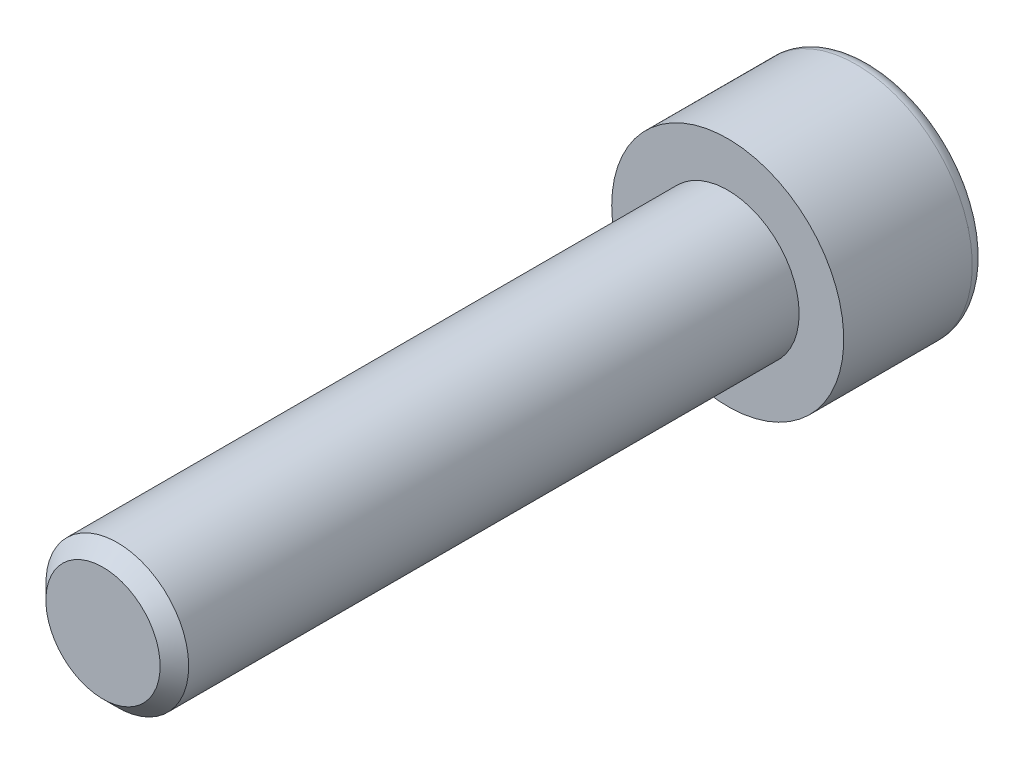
ISO-10303-21;
HEADER;
FILE_DESCRIPTION(('STEP AP214'),'2;1');
FILE_NAME('part.step','',(''),(''),'','','');
FILE_SCHEMA(('AUTOMOTIVE_DESIGN { 1 0 10303 214 1 1 1 1 }'));
ENDSEC;
DATA;
#1=APPLICATION_CONTEXT('core data for automotive mechanical design processes');
#2=APPLICATION_PROTOCOL_DEFINITION('international standard','automotive_design',2000,#1);
#3=PRODUCT_CONTEXT('',#1,'mechanical');
#4=PRODUCT('Part','Part','',(#3));
#5=PRODUCT_RELATED_PRODUCT_CATEGORY('part','',(#4));
#6=PRODUCT_DEFINITION_FORMATION('','',#4);
#7=PRODUCT_DEFINITION_CONTEXT('part definition',#1,'design');
#8=PRODUCT_DEFINITION('design','',#6,#7);
#9=PRODUCT_DEFINITION_SHAPE('','',#8);
#10=(LENGTH_UNIT() NAMED_UNIT(*) SI_UNIT(.MILLI.,.METRE.));
#11=(NAMED_UNIT(*) PLANE_ANGLE_UNIT() SI_UNIT($,.RADIAN.));
#12=(NAMED_UNIT(*) SI_UNIT($,.STERADIAN.) SOLID_ANGLE_UNIT());
#13=UNCERTAINTY_MEASURE_WITH_UNIT(LENGTH_MEASURE(1.E-05),#10,'distance_accuracy_value','');
#14=(GEOMETRIC_REPRESENTATION_CONTEXT(3) GLOBAL_UNCERTAINTY_ASSIGNED_CONTEXT((#13)) GLOBAL_UNIT_ASSIGNED_CONTEXT((#10,
#11,#12)) REPRESENTATION_CONTEXT('',''));
#15=CARTESIAN_POINT('',(0.,0.,0.));
#16=DIRECTION('',(0.,0.,1.));
#17=DIRECTION('',(1.,0.,0.));
#18=AXIS2_PLACEMENT_3D('',#15,#16,#17);
#19=CARTESIAN_POINT('',(0.,0.,-8.));
#20=DIRECTION('',(0.,0.,1.));
#21=DIRECTION('',(1.,0.,0.));
#22=AXIS2_PLACEMENT_3D('',#19,#20,#21);
#23=PLANE('',#22);
#24=CARTESIAN_POINT('',(0.,0.,-8.));
#25=DIRECTION('',(0.,0.,-1.));
#26=DIRECTION('',(-1.,0.,0.));
#27=AXIS2_PLACEMENT_3D('',#24,#25,#26);
#28=CIRCLE('',#27,5.7);
#29=CARTESIAN_POINT('',(-5.7,0.,-8.));
#30=VERTEX_POINT('',#29);
#31=EDGE_CURVE('E147',#30,#30,#28,.T.);
#32=ORIENTED_EDGE('',*,*,#31,.T.);
#33=EDGE_LOOP('',(#32));
#34=FACE_BOUND('',#33,.T.);
#35=DIRECTION('',(-0.86602540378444,0.499999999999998,0.));
#36=VECTOR('',#35,1.);
#37=CARTESIAN_POINT('',(0.,3.46410161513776,-8.));
#38=LINE('',#37,#36);
#39=CARTESIAN_POINT('',(3.,1.73205080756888,-8.));
#40=VERTEX_POINT('',#39);
#41=CARTESIAN_POINT('',(0.,3.46410161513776,-8.));
#42=VERTEX_POINT('',#41);
#43=EDGE_CURVE('E49',#40,#42,#38,.T.);
#44=ORIENTED_EDGE('',*,*,#43,.T.);
#45=DIRECTION('',(-0.866025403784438,-0.500000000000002,0.));
#46=VECTOR('',#45,1.);
#47=CARTESIAN_POINT('',(0.,3.46410161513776,-8.));
#48=LINE('',#47,#46);
#49=CARTESIAN_POINT('',(-3.,1.73205080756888,-8.));
#50=VERTEX_POINT('',#49);
#51=EDGE_CURVE('E120',#42,#50,#48,.T.);
#52=ORIENTED_EDGE('',*,*,#51,.T.);
#53=DIRECTION('',(0.,-1.,0.));
#54=VECTOR('',#53,1.);
#55=CARTESIAN_POINT('',(-3.,-1.73205080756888,-8.));
#56=LINE('',#55,#54);
#57=CARTESIAN_POINT('',(-3.,-1.73205080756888,-8.));
#58=VERTEX_POINT('',#57);
#59=EDGE_CURVE('E124',#50,#58,#56,.T.);
#60=ORIENTED_EDGE('',*,*,#59,.T.);
#61=DIRECTION('',(0.866025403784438,-0.500000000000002,0.));
#62=VECTOR('',#61,1.);
#63=CARTESIAN_POINT('',(0.,-3.46410161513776,-8.));
#64=LINE('',#63,#62);
#65=CARTESIAN_POINT('',(0.,-3.46410161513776,-8.));
#66=VERTEX_POINT('',#65);
#67=EDGE_CURVE('E127',#58,#66,#64,.T.);
#68=ORIENTED_EDGE('',*,*,#67,.T.);
#69=DIRECTION('',(0.86602540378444,0.499999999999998,0.));
#70=VECTOR('',#69,1.);
#71=CARTESIAN_POINT('',(0.,-3.46410161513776,-8.));
#72=LINE('',#71,#70);
#73=CARTESIAN_POINT('',(3.,-1.73205080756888,-8.));
#74=VERTEX_POINT('',#73);
#75=EDGE_CURVE('E110',#66,#74,#72,.T.);
#76=ORIENTED_EDGE('',*,*,#75,.T.);
#77=DIRECTION('',(0.,1.,0.));
#78=VECTOR('',#77,1.);
#79=CARTESIAN_POINT('',(3.,-1.73205080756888,-8.));
#80=LINE('',#79,#78);
#81=EDGE_CURVE('E130',#74,#40,#80,.T.);
#82=ORIENTED_EDGE('',*,*,#81,.T.);
#83=EDGE_LOOP('',(#44,#52,#60,#68,#76,#82));
#84=FACE_BOUND('',#83,.T.);
#85=ADVANCED_FACE('F34',(#34,#84),#23,.F.);
#86=CARTESIAN_POINT('',(0.,0.,-7.2));
#87=DIRECTION('',(0.,0.,-1.));
#88=DIRECTION('',(-1.,0.,0.));
#89=AXIS2_PLACEMENT_3D('',#86,#87,#88);
#90=TOROIDAL_SURFACE('',#89,5.7,0.8);
#91=ORIENTED_EDGE('',*,*,#31,.F.);
#92=EDGE_LOOP('',(#91));
#93=FACE_BOUND('',#92,.T.);
#94=CARTESIAN_POINT('',(0.,0.,-7.2));
#95=DIRECTION('',(0.,0.,-1.));
#96=DIRECTION('',(-1.,0.,0.));
#97=AXIS2_PLACEMENT_3D('',#94,#95,#96);
#98=CIRCLE('',#97,6.5);
#99=CARTESIAN_POINT('',(-6.5,0.,-7.2));
#100=VERTEX_POINT('',#99);
#101=EDGE_CURVE('E144',#100,#100,#98,.T.);
#102=ORIENTED_EDGE('',*,*,#101,.T.);
#103=EDGE_LOOP('',(#102));
#104=FACE_BOUND('',#103,.T.);
#105=ADVANCED_FACE('F164',(#93,#104),#90,.T.);
#106=CARTESIAN_POINT('',(0.,0.,0.));
#107=DIRECTION('',(0.,0.,-1.));
#108=DIRECTION('',(-1.,0.,0.));
#109=AXIS2_PLACEMENT_3D('',#106,#107,#108);
#110=CYLINDRICAL_SURFACE('',#109,6.5);
#111=ORIENTED_EDGE('',*,*,#101,.F.);
#112=EDGE_LOOP('',(#111));
#113=FACE_BOUND('',#112,.T.);
#114=CARTESIAN_POINT('',(0.,0.,0.));
#115=DIRECTION('',(0.,0.,-1.));
#116=DIRECTION('',(-1.,0.,0.));
#117=AXIS2_PLACEMENT_3D('',#114,#115,#116);
#118=CIRCLE('',#117,6.5);
#119=CARTESIAN_POINT('',(-6.5,0.,0.));
#120=VERTEX_POINT('',#119);
#121=EDGE_CURVE('E141',#120,#120,#118,.T.);
#122=ORIENTED_EDGE('',*,*,#121,.T.);
#123=EDGE_LOOP('',(#122));
#124=FACE_BOUND('',#123,.T.);
#125=ADVANCED_FACE('F169',(#113,#124),#110,.T.);
#126=CARTESIAN_POINT('',(0.,0.,0.));
#127=DIRECTION('',(0.,0.,-1.));
#128=DIRECTION('',(-1.,0.,0.));
#129=AXIS2_PLACEMENT_3D('',#126,#127,#128);
#130=PLANE('',#129);
#131=CARTESIAN_POINT('',(0.,0.,0.));
#132=DIRECTION('',(0.,0.,1.));
#133=DIRECTION('',(1.,0.,0.));
#134=AXIS2_PLACEMENT_3D('',#131,#132,#133);
#135=CIRCLE('',#134,4.);
#136=CARTESIAN_POINT('',(4.,0.,0.));
#137=VERTEX_POINT('',#136);
#138=EDGE_CURVE('E121',#137,#137,#135,.T.);
#139=ORIENTED_EDGE('',*,*,#138,.F.);
#140=EDGE_LOOP('',(#139));
#141=FACE_BOUND('',#140,.T.);
#142=ORIENTED_EDGE('',*,*,#121,.F.);
#143=EDGE_LOOP('',(#142));
#144=FACE_BOUND('',#143,.T.);
#145=ADVANCED_FACE('F176',(#141,#144),#130,.F.);
#146=CARTESIAN_POINT('',(0.,3.46410161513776,-4.));
#147=DIRECTION('',(-0.499999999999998,-0.86602540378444,0.));
#148=DIRECTION('',(0.86602540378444,-0.499999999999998,0.));
#149=AXIS2_PLACEMENT_3D('',#146,#147,#148);
#150=PLANE('',#149);
#151=ORIENTED_EDGE('',*,*,#43,.F.);
#152=DIRECTION('',(0.,0.,-1.));
#153=VECTOR('',#152,1.);
#154=CARTESIAN_POINT('',(3.,1.73205080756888,-4.));
#155=LINE('',#154,#153);
#156=CARTESIAN_POINT('',(3.,1.73205080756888,-4.));
#157=VERTEX_POINT('',#156);
#158=EDGE_CURVE('E115',#157,#40,#155,.T.);
#159=ORIENTED_EDGE('',*,*,#158,.F.);
#160=DIRECTION('',(-0.86602540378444,0.499999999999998,0.));
#161=VECTOR('',#160,1.);
#162=CARTESIAN_POINT('',(0.,3.46410161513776,-4.));
#163=LINE('',#162,#161);
#164=CARTESIAN_POINT('',(0.,3.46410161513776,-4.));
#165=VERTEX_POINT('',#164);
#166=EDGE_CURVE('E133',#157,#165,#163,.T.);
#167=ORIENTED_EDGE('',*,*,#166,.T.);
#168=DIRECTION('',(0.,0.,-1.));
#169=VECTOR('',#168,1.);
#170=CARTESIAN_POINT('',(0.,3.46410161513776,-4.));
#171=LINE('',#170,#169);
#172=EDGE_CURVE('E139',#165,#42,#171,.T.);
#173=ORIENTED_EDGE('',*,*,#172,.T.);
#174=EDGE_LOOP('',(#151,#159,#167,#173));
#175=FACE_BOUND('',#174,.T.);
#176=ADVANCED_FACE('F180',(#175),#150,.T.);
#177=CARTESIAN_POINT('',(0.,3.46410161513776,-4.));
#178=DIRECTION('',(0.500000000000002,-0.866025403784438,0.));
#179=DIRECTION('',(0.866025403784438,0.500000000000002,0.));
#180=AXIS2_PLACEMENT_3D('',#177,#178,#179);
#181=PLANE('',#180);
#182=ORIENTED_EDGE('',*,*,#51,.F.);
#183=ORIENTED_EDGE('',*,*,#172,.F.);
#184=DIRECTION('',(-0.866025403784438,-0.500000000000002,0.));
#185=VECTOR('',#184,1.);
#186=CARTESIAN_POINT('',(0.,3.46410161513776,-4.));
#187=LINE('',#186,#185);
#188=CARTESIAN_POINT('',(-3.,1.73205080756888,-4.));
#189=VERTEX_POINT('',#188);
#190=EDGE_CURVE('E88',#165,#189,#187,.T.);
#191=ORIENTED_EDGE('',*,*,#190,.T.);
#192=DIRECTION('',(0.,0.,-1.));
#193=VECTOR('',#192,1.);
#194=CARTESIAN_POINT('',(-3.,1.73205080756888,-4.));
#195=LINE('',#194,#193);
#196=EDGE_CURVE('E137',#189,#50,#195,.T.);
#197=ORIENTED_EDGE('',*,*,#196,.T.);
#198=EDGE_LOOP('',(#182,#183,#191,#197));
#199=FACE_BOUND('',#198,.T.);
#200=ADVANCED_FACE('F184',(#199),#181,.T.);
#201=CARTESIAN_POINT('',(-3.,-1.73205080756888,-4.));
#202=DIRECTION('',(1.,0.,0.));
#203=DIRECTION('',(0.,0.,-1.));
#204=AXIS2_PLACEMENT_3D('',#201,#202,#203);
#205=PLANE('',#204);
#206=ORIENTED_EDGE('',*,*,#59,.F.);
#207=ORIENTED_EDGE('',*,*,#196,.F.);
#208=DIRECTION('',(0.,-1.,0.));
#209=VECTOR('',#208,1.);
#210=CARTESIAN_POINT('',(-3.,-1.73205080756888,-4.));
#211=LINE('',#210,#209);
#212=CARTESIAN_POINT('',(-3.,-1.73205080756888,-4.));
#213=VERTEX_POINT('',#212);
#214=EDGE_CURVE('E106',#189,#213,#211,.T.);
#215=ORIENTED_EDGE('',*,*,#214,.T.);
#216=DIRECTION('',(0.,0.,-1.));
#217=VECTOR('',#216,1.);
#218=CARTESIAN_POINT('',(-3.,-1.73205080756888,-4.));
#219=LINE('',#218,#217);
#220=EDGE_CURVE('E103',#213,#58,#219,.T.);
#221=ORIENTED_EDGE('',*,*,#220,.T.);
#222=EDGE_LOOP('',(#206,#207,#215,#221));
#223=FACE_BOUND('',#222,.T.);
#224=ADVANCED_FACE('F187',(#223),#205,.T.);
#225=CARTESIAN_POINT('',(0.,-3.46410161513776,-4.));
#226=DIRECTION('',(0.500000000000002,0.866025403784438,0.));
#227=DIRECTION('',(-0.866025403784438,0.500000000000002,0.));
#228=AXIS2_PLACEMENT_3D('',#225,#226,#227);
#229=PLANE('',#228);
#230=ORIENTED_EDGE('',*,*,#67,.F.);
#231=ORIENTED_EDGE('',*,*,#220,.F.);
#232=DIRECTION('',(0.866025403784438,-0.500000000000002,0.));
#233=VECTOR('',#232,1.);
#234=CARTESIAN_POINT('',(0.,-3.46410161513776,-4.));
#235=LINE('',#234,#233);
#236=CARTESIAN_POINT('',(0.,-3.46410161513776,-4.));
#237=VERTEX_POINT('',#236);
#238=EDGE_CURVE('E98',#213,#237,#235,.T.);
#239=ORIENTED_EDGE('',*,*,#238,.T.);
#240=DIRECTION('',(0.,0.,-1.));
#241=VECTOR('',#240,1.);
#242=CARTESIAN_POINT('',(0.,-3.46410161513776,-4.));
#243=LINE('',#242,#241);
#244=EDGE_CURVE('E102',#237,#66,#243,.T.);
#245=ORIENTED_EDGE('',*,*,#244,.T.);
#246=EDGE_LOOP('',(#230,#231,#239,#245));
#247=FACE_BOUND('',#246,.T.);
#248=ADVANCED_FACE('F101',(#247),#229,.T.);
#249=CARTESIAN_POINT('',(0.,-3.46410161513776,-4.));
#250=DIRECTION('',(-0.499999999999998,0.86602540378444,0.));
#251=DIRECTION('',(-0.86602540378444,-0.499999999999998,0.));
#252=AXIS2_PLACEMENT_3D('',#249,#250,#251);
#253=PLANE('',#252);
#254=ORIENTED_EDGE('',*,*,#75,.F.);
#255=ORIENTED_EDGE('',*,*,#244,.F.);
#256=DIRECTION('',(0.86602540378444,0.499999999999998,0.));
#257=VECTOR('',#256,1.);
#258=CARTESIAN_POINT('',(0.,-3.46410161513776,-4.));
#259=LINE('',#258,#257);
#260=CARTESIAN_POINT('',(3.,-1.73205080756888,-4.));
#261=VERTEX_POINT('',#260);
#262=EDGE_CURVE('E105',#237,#261,#259,.T.);
#263=ORIENTED_EDGE('',*,*,#262,.T.);
#264=DIRECTION('',(0.,0.,-1.));
#265=VECTOR('',#264,1.);
#266=CARTESIAN_POINT('',(3.,-1.73205080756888,-4.));
#267=LINE('',#266,#265);
#268=EDGE_CURVE('E79',#261,#74,#267,.T.);
#269=ORIENTED_EDGE('',*,*,#268,.T.);
#270=EDGE_LOOP('',(#254,#255,#263,#269));
#271=FACE_BOUND('',#270,.T.);
#272=ADVANCED_FACE('F108',(#271),#253,.T.);
#273=CARTESIAN_POINT('',(3.,-1.73205080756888,-4.));
#274=DIRECTION('',(-1.,0.,0.));
#275=DIRECTION('',(0.,0.,1.));
#276=AXIS2_PLACEMENT_3D('',#273,#274,#275);
#277=PLANE('',#276);
#278=ORIENTED_EDGE('',*,*,#81,.F.);
#279=ORIENTED_EDGE('',*,*,#268,.F.);
#280=DIRECTION('',(0.,1.,0.));
#281=VECTOR('',#280,1.);
#282=CARTESIAN_POINT('',(3.,-1.73205080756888,-4.));
#283=LINE('',#282,#281);
#284=EDGE_CURVE('E57',#261,#157,#283,.T.);
#285=ORIENTED_EDGE('',*,*,#284,.T.);
#286=ORIENTED_EDGE('',*,*,#158,.T.);
#287=EDGE_LOOP('',(#278,#279,#285,#286));
#288=FACE_BOUND('',#287,.T.);
#289=ADVANCED_FACE('F196',(#288),#277,.T.);
#290=CARTESIAN_POINT('',(3.,1.73205080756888,-4.));
#291=DIRECTION('',(0.,0.,1.));
#292=DIRECTION('',(1.,0.,0.));
#293=AXIS2_PLACEMENT_3D('',#290,#291,#292);
#294=PLANE('',#293);
#295=ORIENTED_EDGE('',*,*,#166,.F.);
#296=ORIENTED_EDGE('',*,*,#284,.F.);
#297=ORIENTED_EDGE('',*,*,#262,.F.);
#298=ORIENTED_EDGE('',*,*,#238,.F.);
#299=ORIENTED_EDGE('',*,*,#214,.F.);
#300=ORIENTED_EDGE('',*,*,#190,.F.);
#301=EDGE_LOOP('',(#295,#296,#297,#298,#299,#300));
#302=FACE_BOUND('',#301,.T.);
#303=ADVANCED_FACE('F113',(#302),#294,.F.);
#304=CARTESIAN_POINT('',(0.,0.,35.));
#305=DIRECTION('',(0.,0.,1.));
#306=DIRECTION('',(1.,0.,0.));
#307=AXIS2_PLACEMENT_3D('',#304,#305,#306);
#308=PLANE('',#307);
#309=CARTESIAN_POINT('',(0.,0.,35.));
#310=DIRECTION('',(0.,0.,1.));
#311=DIRECTION('',(1.,0.,0.));
#312=AXIS2_PLACEMENT_3D('',#309,#310,#311);
#313=CIRCLE('',#312,3.2);
#314=CARTESIAN_POINT('',(3.2,0.,35.));
#315=VERTEX_POINT('',#314);
#316=EDGE_CURVE('E42',#315,#315,#313,.T.);
#317=ORIENTED_EDGE('',*,*,#316,.T.);
#318=EDGE_LOOP('',(#317));
#319=FACE_BOUND('',#318,.T.);
#320=ADVANCED_FACE('F152',(#319),#308,.T.);
#321=CARTESIAN_POINT('',(0.,0.,0.));
#322=DIRECTION('',(0.,0.,1.));
#323=DIRECTION('',(1.,0.,0.));
#324=AXIS2_PLACEMENT_3D('',#321,#322,#323);
#325=CYLINDRICAL_SURFACE('',#324,4.);
#326=CARTESIAN_POINT('',(0.,0.,34.2));
#327=DIRECTION('',(0.,0.,1.));
#328=DIRECTION('',(1.,0.,0.));
#329=AXIS2_PLACEMENT_3D('',#326,#327,#328);
#330=CIRCLE('',#329,4.);
#331=CARTESIAN_POINT('',(4.,0.,34.2));
#332=VERTEX_POINT('',#331);
#333=EDGE_CURVE('E11',#332,#332,#330,.F.);
#334=ORIENTED_EDGE('',*,*,#333,.T.);
#335=EDGE_LOOP('',(#334));
#336=FACE_BOUND('',#335,.T.);
#337=ORIENTED_EDGE('',*,*,#138,.T.);
#338=EDGE_LOOP('',(#337));
#339=FACE_BOUND('',#338,.T.);
#340=ADVANCED_FACE('F155',(#336,#339),#325,.T.);
#341=CARTESIAN_POINT('',(0.,0.,35.));
#342=DIRECTION('',(0.,0.,-1.));
#343=DIRECTION('',(-1.,0.,0.));
#344=AXIS2_PLACEMENT_3D('',#341,#342,#343);
#345=CONICAL_SURFACE('',#344,3.2,0.785398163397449);
#346=ORIENTED_EDGE('',*,*,#333,.F.);
#347=EDGE_LOOP('',(#346));
#348=FACE_BOUND('',#347,.T.);
#349=ORIENTED_EDGE('',*,*,#316,.F.);
#350=EDGE_LOOP('',(#349));
#351=FACE_BOUND('',#350,.T.);
#352=ADVANCED_FACE('F36',(#348,#351),#345,.T.);
#353=CLOSED_SHELL('',(#85,#105,#125,#145,#176,#200,#224,#248,#272,#289,#303,#320,#340,#352));
#354=MANIFOLD_SOLID_BREP('B2',#353);
#355=ADVANCED_BREP_SHAPE_REPRESENTATION('',(#18,#354),#14);
#356=SHAPE_DEFINITION_REPRESENTATION(#9,#355);
ENDSEC;
END-ISO-10303-21;
